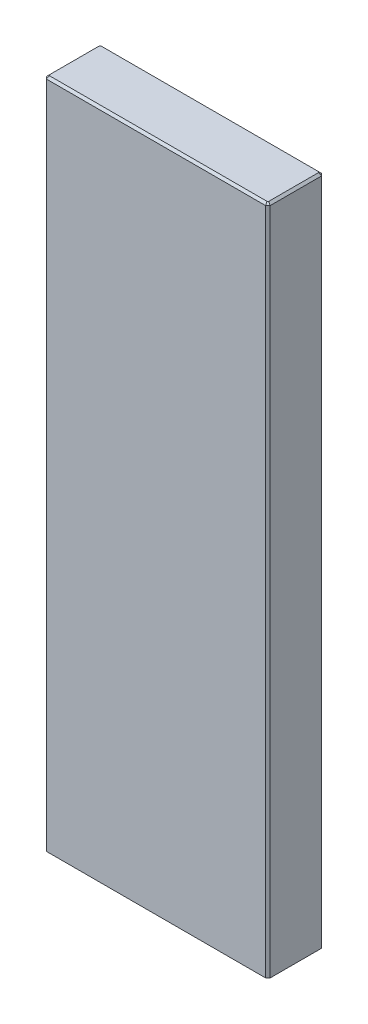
from build123d import *

# Parameters (mm, degrees)
SKETCH1_W      = 50.8
SKETCH1_H      = 152.4
EXTRUDE1_DEPTH = 12.7
CHAMFER1_SIZE  = 0.5
CHAMFER2_SIZE  = 0.5


with BuildPart() as part:
    # Sketch1 → Extrude1 (new body)
    with BuildSketch(Plane.XY):
        with Locations((0, 76.2)):
            Rectangle(SKETCH1_W, SKETCH1_H)
    extrude(amount=EXTRUDE1_DEPTH)

    # Sketch2 → 10-32 Tapped Hole1 (revolve, cut)
    with BuildSketch(Plane(origin=(14.0875, 0, 6.35), x_dir=(0, 0, -1), z_dir=(1, 0, 0))):
        Polygon((0, 0), (0, 28.993317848), (2.0193, 27.78), (2.0193, 25.4), (2.413, 25.4), (2.413, 0.635), (3.048, 0), align=None)
    revolve(axis=Axis((14.0875, -6.35, 6.35), (0, 1, 0)), mode=Mode.SUBTRACT)

    # Chamfer1
    chamfer1_edges = [part.edges().sort_by_distance(p)[0] for p in [
        (25.4, 76.2, 12.7),
        (-25.4, 76.2, 12.7),
        (25.4, 76.2, 0),
        (-25.4, 76.2, 0),
    ]]
    chamfer(chamfer1_edges, length=CHAMFER1_SIZE)

    # Chamfer2
    chamfer2_edges = [part.edges().sort_by_distance(p)[0] for p in [
        (25.4, 152.4, 6.35),
        (0, 152.4, 0),
        (-25.4, 152.4, 6.35),
        (0, 152.4, 12.7),
        (-25.15, 152.4, 12.45),
        (-25.15, 152.4, 0.25),
        (25.15, 152.4, 12.45),
        (25.15, 152.4, 0.25),
    ]]
    chamfer(chamfer2_edges, length=CHAMFER2_SIZE)


solid = part.part
